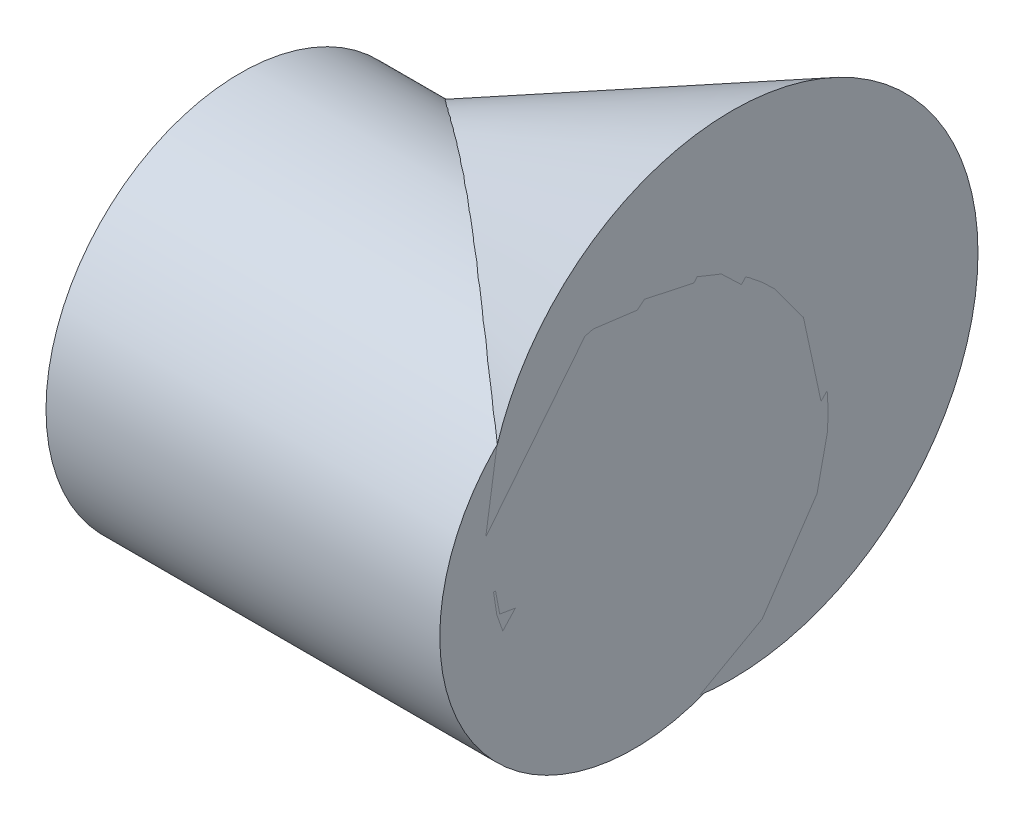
from build123d import *

# Parameters (mm, degrees)
SKETCH_3_R      = 19.723642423
EXTRUDE_1_DEPTH = 40


with BuildPart() as part:
    # Sketch 1 → Revolve 1 (revolve)
    with BuildSketch(Plane.XY, mode=Mode.PRIVATE) as revolve_1_sk:
        Polygon((-47.998529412, 0), (2.001470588, 25), (2.001470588, 0), align=None)
    revolve(revolve_1_sk.sketch.rotate(Axis((-69.289705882, 0, 0), (1, 0, 0)), 270), axis=Axis((-69.289705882, 0, 0), (1, 0, 0)))


with BuildPart() as body_2:
    # Sketch 3 → Extrude 1 (new body)
    with BuildSketch(Plane(origin=(2.001470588, 0, 0), x_dir=(0, 0, -1), z_dir=(1, 0, 0))):
        with Locations((-9.948096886, -6.439830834)):
            Circle(SKETCH_3_R)
    extrude(amount=-EXTRUDE_1_DEPTH)


solid = Compound([part.part, body_2.part])
